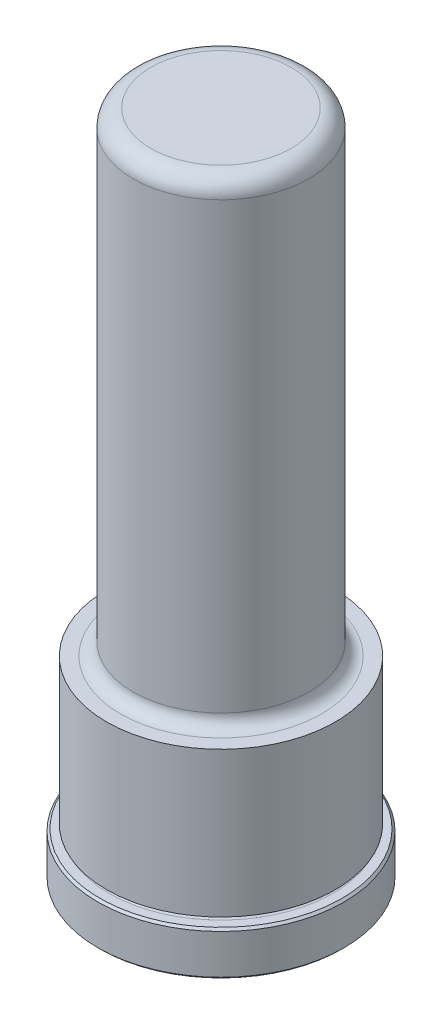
from build123d import *

# Parameters (mm, degrees)
CHAMFER1_SIZE = 0.381
FILLET7_R     = 3.175


with BuildPart() as part:
    # Sketch1 → Revolve1 (revolve)
    with BuildSketch(Plane(origin=(0, 0, 0), x_dir=(0, 0, -1), z_dir=(1, 0, 0)), mode=Mode.PRIVATE) as revolve1_sk:
        with BuildLine():
            Line((0, 0), (22.225, 0))
            Line((22.225, 0), (22.225, 7.9248))
            Line((22.225, 7.9248), (20.2438, 7.9248))
            ThreePointArc((20.2438, 7.9248), (19.8628, 8.3058), (20.2438, 8.6868))
            Line((20.2438, 8.6868), (20.6502, 8.6868))
            Line((20.6502, 8.6868), (20.6502, 34.925))
            Line((20.6502, 34.925), (18.1483, 34.925))
            ThreePointArc((18.1483, 34.925), (16.531853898, 35.594553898), (15.8623, 37.211))
            Line((15.8623, 37.211), (15.8623, 120.65))
            Line((15.8623, 120.65), (0, 120.65))
            Line((0, 120.65), (0, 0))
        make_face()
    revolve(revolve1_sk.sketch.rotate(Axis((0, 0, 0), (0, -1, 0)), 180), axis=Axis((0, 0, 0), (0, -1, 0)))

    # Chamfer1
    chamfer1_edges = [part.edges().sort_by_distance(p)[0] for p in [
        (0, 7.9248, -22.225),
        (0, 0, -22.225),
    ]]
    chamfer(chamfer1_edges, length=CHAMFER1_SIZE)

    # Fillet7
    fillet7_edges = [part.edges().sort_by_distance(p)[0] for p in [
        (0, 120.65, -15.8623),
    ]]
    fillet(fillet7_edges, radius=FILLET7_R)


solid = part.part
